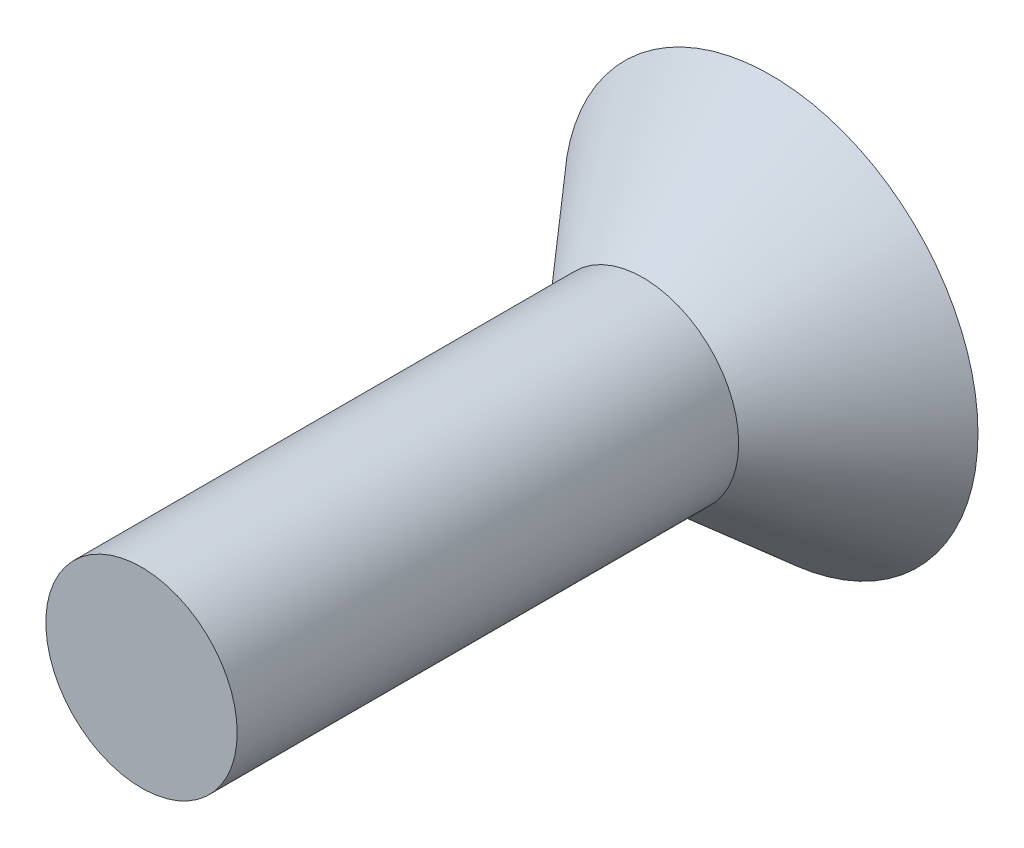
from build123d import *

# Parameters (mm, degrees)
HEX_2_DEPTH = 3.048


with BuildPart() as part:
    # Sketch6 → Revolve1 (revolve)
    with BuildSketch(Plane(origin=(0, 0, 0), x_dir=(0, 0, -1), z_dir=(1, 0, 0)), mode=Mode.PRIVATE) as revolve1_sk:
        Polygon((-15.875, 0), (-15.875, -2.413), (-3.228739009, -2.413), (0, -5.2197), (0, 0), align=None)
    revolve(revolve1_sk.sketch.rotate(Axis((0, 0, 15.875), (0, 0, -1)), 270), axis=Axis((0, 0, 15.875), (0, 0, -1)))

    # Sketch7 → HEX 2 (cut)
    with BuildSketch(Plane(origin=(0, 0, 0), x_dir=(-1, 0, 0), z_dir=(0, 0, -1))):
        Polygon((-1.5875, 0.916543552), (-1.5875, -0.916543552), (0, -1.833087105), (1.5875, -0.916543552), (1.5875, 0.916543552), (0, 1.833087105), align=None)
    extrude(amount=-HEX_2_DEPTH, mode=Mode.SUBTRACT)


solid = part.part
